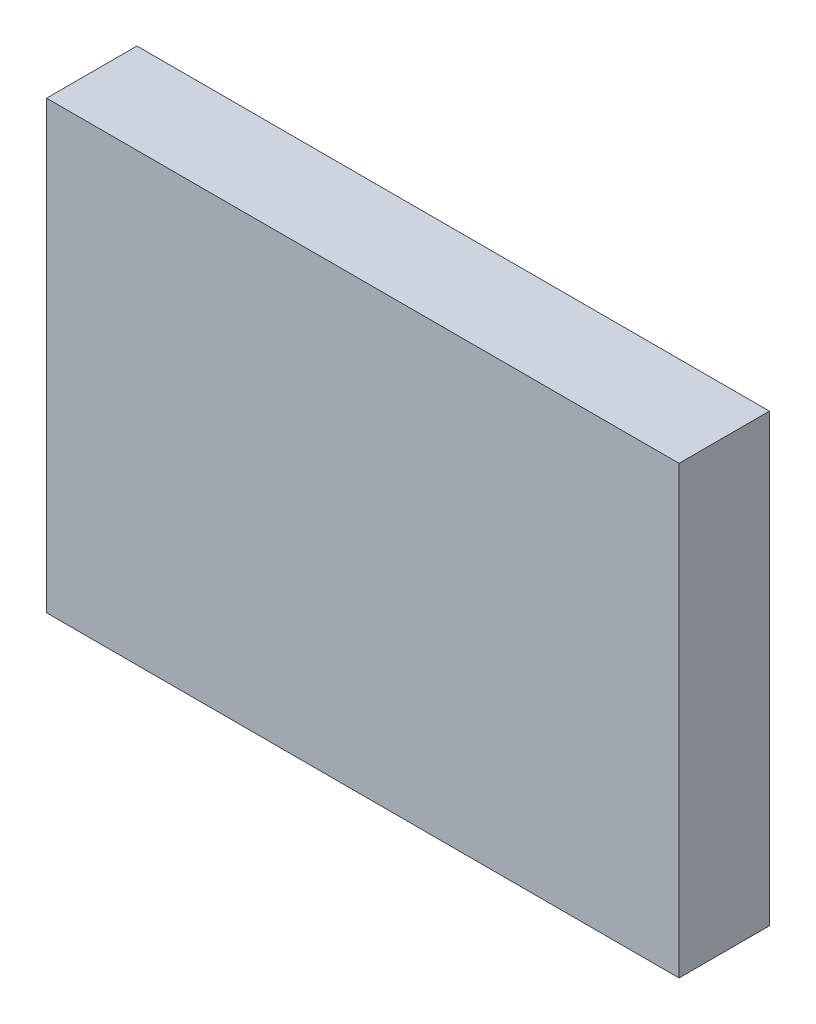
from build123d import *

# Parameters (mm, degrees)
ESQUISSE1_W        = 210
ESQUISSE1_H        = 148
BOSS_EXTRU_1_DEPTH = 30


with BuildPart() as part:
    # Esquisse1 → Boss.-Extru.1 (new body)
    with BuildSketch(Plane.XY):
        with Locations((105, 74)):
            Rectangle(ESQUISSE1_W, ESQUISSE1_H)
    extrude(amount=BOSS_EXTRU_1_DEPTH)


solid = part.part
